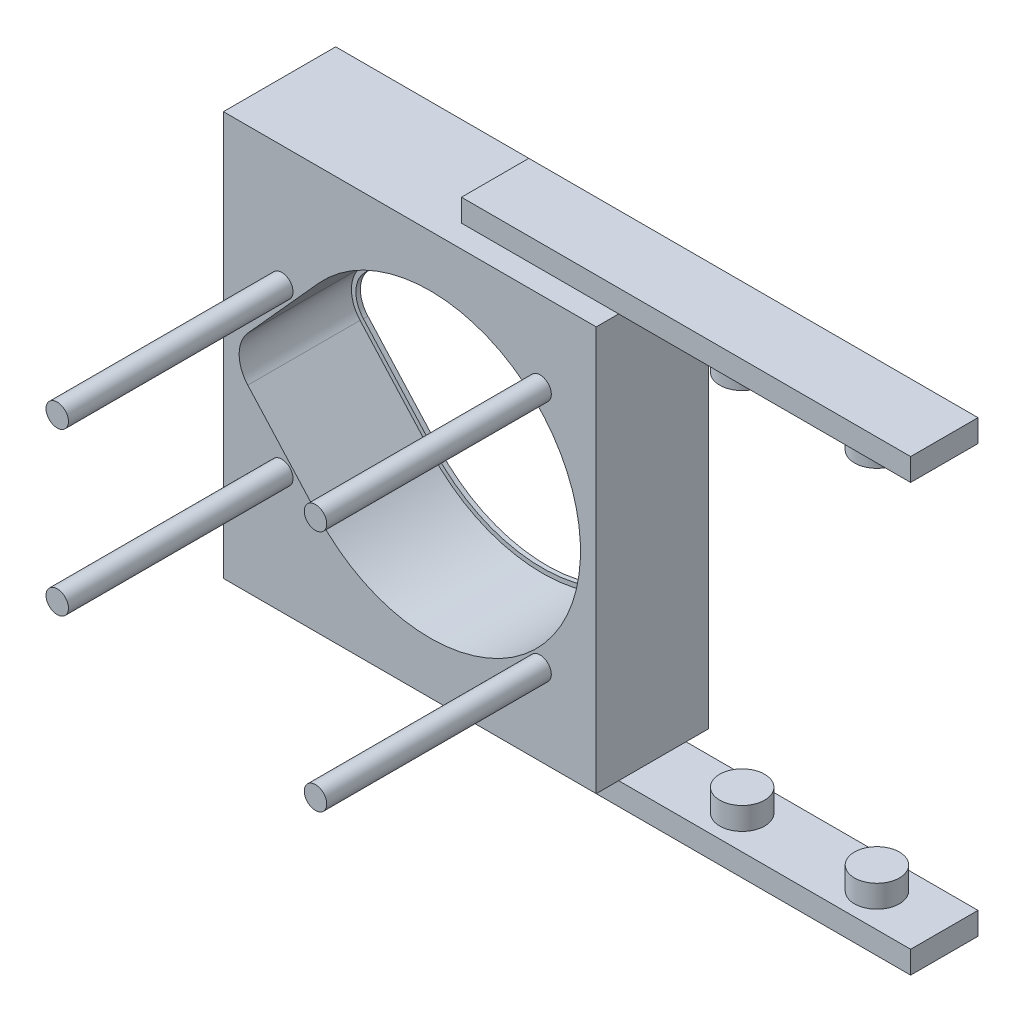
ISO-10303-21;
HEADER;
FILE_DESCRIPTION(('STEP AP214'),'2;1');
FILE_NAME('part.step','',(''),(''),'','','');
FILE_SCHEMA(('AUTOMOTIVE_DESIGN { 1 0 10303 214 1 1 1 1 }'));
ENDSEC;
DATA;
#1=APPLICATION_CONTEXT('core data for automotive mechanical design processes');
#2=APPLICATION_PROTOCOL_DEFINITION('international standard','automotive_design',2000,#1);
#3=PRODUCT_CONTEXT('',#1,'mechanical');
#4=PRODUCT('Part','Part','',(#3));
#5=PRODUCT_RELATED_PRODUCT_CATEGORY('part','',(#4));
#6=PRODUCT_DEFINITION_FORMATION('','',#4);
#7=PRODUCT_DEFINITION_CONTEXT('part definition',#1,'design');
#8=PRODUCT_DEFINITION('design','',#6,#7);
#9=PRODUCT_DEFINITION_SHAPE('','',#8);
#10=(LENGTH_UNIT() NAMED_UNIT(*) SI_UNIT(.MILLI.,.METRE.));
#11=(NAMED_UNIT(*) PLANE_ANGLE_UNIT() SI_UNIT($,.RADIAN.));
#12=(NAMED_UNIT(*) SI_UNIT($,.STERADIAN.) SOLID_ANGLE_UNIT());
#13=UNCERTAINTY_MEASURE_WITH_UNIT(LENGTH_MEASURE(1.E-05),#10,'distance_accuracy_value','');
#14=(GEOMETRIC_REPRESENTATION_CONTEXT(3) GLOBAL_UNCERTAINTY_ASSIGNED_CONTEXT((#13)) GLOBAL_UNIT_ASSIGNED_CONTEXT((#10,
#11,#12)) REPRESENTATION_CONTEXT('',''));
#15=CARTESIAN_POINT('',(0.,0.,0.));
#16=DIRECTION('',(0.,0.,1.));
#17=DIRECTION('',(1.,0.,0.));
#18=AXIS2_PLACEMENT_3D('',#15,#16,#17);
#19=CARTESIAN_POINT('',(0.,90.,0.));
#20=DIRECTION('',(0.,0.,-1.));
#21=DIRECTION('',(-1.,0.,0.));
#22=AXIS2_PLACEMENT_3D('',#19,#20,#21);
#23=PLANE('',#22);
#24=DIRECTION('',(0.,-1.,0.));
#25=VECTOR('',#24,1.);
#26=CARTESIAN_POINT('',(0.,0.,0.));
#27=LINE('',#26,#25);
#28=CARTESIAN_POINT('',(0.,90.,0.));
#29=VERTEX_POINT('',#28);
#30=CARTESIAN_POINT('',(0.,0.,0.));
#31=VERTEX_POINT('',#30);
#32=EDGE_CURVE('E400',#29,#31,#27,.T.);
#33=ORIENTED_EDGE('',*,*,#32,.F.);
#34=DIRECTION('',(-1.,0.,0.));
#35=VECTOR('',#34,1.);
#36=CARTESIAN_POINT('',(0.,90.,0.));
#37=LINE('',#36,#35);
#38=CARTESIAN_POINT('',(83.,90.,0.));
#39=VERTEX_POINT('',#38);
#40=EDGE_CURVE('E409',#39,#29,#37,.T.);
#41=ORIENTED_EDGE('',*,*,#40,.F.);
#42=DIRECTION('',(0.,1.,0.));
#43=VECTOR('',#42,1.);
#44=CARTESIAN_POINT('',(83.,0.,0.));
#45=LINE('',#44,#43);
#46=CARTESIAN_POINT('',(83.,0.,0.));
#47=VERTEX_POINT('',#46);
#48=EDGE_CURVE('E406',#47,#39,#45,.T.);
#49=ORIENTED_EDGE('',*,*,#48,.F.);
#50=DIRECTION('',(1.,0.,0.));
#51=VECTOR('',#50,1.);
#52=CARTESIAN_POINT('',(0.,0.,0.));
#53=LINE('',#52,#51);
#54=EDGE_CURVE('E403',#31,#47,#53,.T.);
#55=ORIENTED_EDGE('',*,*,#54,.F.);
#56=EDGE_LOOP('',(#33,#41,#49,#55));
#57=FACE_BOUND('',#56,.T.);
#58=DIRECTION('',(-0.66944997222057,0.742857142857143,0.));
#59=VECTOR('',#58,1.);
#60=CARTESIAN_POINT('',(20.3714285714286,21.9039759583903,0.));
#61=LINE('',#60,#59);
#62=CARTESIAN_POINT('',(20.3714285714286,21.9039759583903,0.));
#63=VERTEX_POINT('',#62);
#64=CARTESIAN_POINT('',(4.68571428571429,39.3096752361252,0.));
#65=VERTEX_POINT('',#64);
#66=EDGE_CURVE('E246',#63,#65,#61,.T.);
#67=ORIENTED_EDGE('',*,*,#66,.F.);
#68=CARTESIAN_POINT('',(46.,45.,0.));
#69=DIRECTION('',(0.,0.,-1.));
#70=DIRECTION('',(-1.,0.,0.));
#71=AXIS2_PLACEMENT_3D('',#68,#69,#70);
#72=CIRCLE('',#71,34.5);
#73=CARTESIAN_POINT('',(20.3714285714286,68.0960240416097,0.));
#74=VERTEX_POINT('',#73);
#75=EDGE_CURVE('E220',#74,#63,#72,.T.);
#76=ORIENTED_EDGE('',*,*,#75,.F.);
#77=DIRECTION('',(0.669449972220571,0.742857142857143,0.));
#78=VECTOR('',#77,1.);
#79=CARTESIAN_POINT('',(4.68571428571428,50.6903247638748,0.));
#80=LINE('',#79,#78);
#81=CARTESIAN_POINT('',(4.68571428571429,50.6903247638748,0.));
#82=VERTEX_POINT('',#81);
#83=EDGE_CURVE('E250',#82,#74,#80,.T.);
#84=ORIENTED_EDGE('',*,*,#83,.F.);
#85=CARTESIAN_POINT('',(11.,45.,0.));
#86=DIRECTION('',(0.,0.,-1.));
#87=DIRECTION('',(-1.,0.,0.));
#88=AXIS2_PLACEMENT_3D('',#85,#86,#87);
#89=CIRCLE('',#88,8.5);
#90=EDGE_CURVE('E248',#65,#82,#89,.T.);
#91=ORIENTED_EDGE('',*,*,#90,.F.);
#92=EDGE_LOOP('',(#67,#76,#84,#91));
#93=FACE_BOUND('',#92,.T.);
#94=ADVANCED_FACE('F26',(#57,#93),#23,.T.);
#95=CARTESIAN_POINT('',(0.,90.,25.));
#96=DIRECTION('',(0.,0.,-1.));
#97=DIRECTION('',(-1.,0.,0.));
#98=AXIS2_PLACEMENT_3D('',#95,#96,#97);
#99=PLANE('',#98);
#100=CARTESIAN_POINT('',(70.5,18.,25.));
#101=DIRECTION('',(0.,0.,-1.));
#102=DIRECTION('',(-1.,0.,0.));
#103=AXIS2_PLACEMENT_3D('',#100,#101,#102);
#104=CIRCLE('',#103,2.5);
#105=CARTESIAN_POINT('',(68.,18.,25.));
#106=VERTEX_POINT('',#105);
#107=EDGE_CURVE('E34',#106,#106,#104,.F.);
#108=ORIENTED_EDGE('',*,*,#107,.F.);
#109=EDGE_LOOP('',(#108));
#110=FACE_BOUND('',#109,.T.);
#111=CARTESIAN_POINT('',(13.,63.,25.));
#112=DIRECTION('',(0.,0.,-1.));
#113=DIRECTION('',(-1.,0.,0.));
#114=AXIS2_PLACEMENT_3D('',#111,#112,#113);
#115=CIRCLE('',#114,2.5);
#116=CARTESIAN_POINT('',(10.5,63.,25.));
#117=VERTEX_POINT('',#116);
#118=EDGE_CURVE('E442',#117,#117,#115,.F.);
#119=ORIENTED_EDGE('',*,*,#118,.F.);
#120=EDGE_LOOP('',(#119));
#121=FACE_BOUND('',#120,.T.);
#122=DIRECTION('',(0.66944997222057,-0.742857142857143,0.));
#123=VECTOR('',#122,1.);
#124=CARTESIAN_POINT('',(5.42857142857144,39.9791252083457,25.));
#125=LINE('',#124,#123);
#126=CARTESIAN_POINT('',(5.42857142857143,39.9791252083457,25.));
#127=VERTEX_POINT('',#126);
#128=CARTESIAN_POINT('',(21.1142857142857,22.5734259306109,25.));
#129=VERTEX_POINT('',#128);
#130=EDGE_CURVE('E283',#127,#129,#125,.T.);
#131=ORIENTED_EDGE('',*,*,#130,.F.);
#132=CARTESIAN_POINT('',(11.,45.,25.));
#133=DIRECTION('',(0.,0.,1.));
#134=DIRECTION('',(1.,0.,0.));
#135=AXIS2_PLACEMENT_3D('',#132,#133,#134);
#136=CIRCLE('',#135,7.5);
#137=CARTESIAN_POINT('',(5.42857142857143,50.0208747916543,25.));
#138=VERTEX_POINT('',#137);
#139=EDGE_CURVE('E49',#138,#127,#136,.T.);
#140=ORIENTED_EDGE('',*,*,#139,.F.);
#141=DIRECTION('',(-0.669449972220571,-0.742857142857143,0.));
#142=VECTOR('',#141,1.);
#143=CARTESIAN_POINT('',(5.42857142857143,50.0208747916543,25.));
#144=LINE('',#143,#142);
#145=CARTESIAN_POINT('',(21.1142857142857,67.4265740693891,25.));
#146=VERTEX_POINT('',#145);
#147=EDGE_CURVE('E289',#146,#138,#144,.T.);
#148=ORIENTED_EDGE('',*,*,#147,.F.);
#149=CARTESIAN_POINT('',(46.,45.,25.));
#150=DIRECTION('',(0.,0.,1.));
#151=DIRECTION('',(1.,0.,0.));
#152=AXIS2_PLACEMENT_3D('',#149,#150,#151);
#153=CIRCLE('',#152,33.5);
#154=EDGE_CURVE('E286',#129,#146,#153,.T.);
#155=ORIENTED_EDGE('',*,*,#154,.F.);
#156=EDGE_LOOP('',(#131,#140,#148,#155));
#157=FACE_BOUND('',#156,.T.);
#158=DIRECTION('',(0.,-1.,0.));
#159=VECTOR('',#158,1.);
#160=CARTESIAN_POINT('',(0.,0.,25.));
#161=LINE('',#160,#159);
#162=CARTESIAN_POINT('',(0.,90.,25.));
#163=VERTEX_POINT('',#162);
#164=CARTESIAN_POINT('',(0.,0.,25.));
#165=VERTEX_POINT('',#164);
#166=EDGE_CURVE('E411',#163,#165,#161,.T.);
#167=ORIENTED_EDGE('',*,*,#166,.T.);
#168=DIRECTION('',(1.,0.,0.));
#169=VECTOR('',#168,1.);
#170=CARTESIAN_POINT('',(0.,0.,25.));
#171=LINE('',#170,#169);
#172=CARTESIAN_POINT('',(83.,0.,25.));
#173=VERTEX_POINT('',#172);
#174=EDGE_CURVE('E414',#165,#173,#171,.T.);
#175=ORIENTED_EDGE('',*,*,#174,.T.);
#176=DIRECTION('',(0.,1.,0.));
#177=VECTOR('',#176,1.);
#178=CARTESIAN_POINT('',(83.,0.,25.));
#179=LINE('',#178,#177);
#180=CARTESIAN_POINT('',(83.,90.,25.));
#181=VERTEX_POINT('',#180);
#182=EDGE_CURVE('E417',#173,#181,#179,.T.);
#183=ORIENTED_EDGE('',*,*,#182,.T.);
#184=DIRECTION('',(-1.,0.,0.));
#185=VECTOR('',#184,1.);
#186=CARTESIAN_POINT('',(0.,90.,25.));
#187=LINE('',#186,#185);
#188=EDGE_CURVE('E419',#181,#163,#187,.T.);
#189=ORIENTED_EDGE('',*,*,#188,.T.);
#190=EDGE_LOOP('',(#167,#175,#183,#189));
#191=FACE_BOUND('',#190,.T.);
#192=CARTESIAN_POINT('',(70.5,72.,25.));
#193=DIRECTION('',(0.,0.,-1.));
#194=DIRECTION('',(-1.,0.,0.));
#195=AXIS2_PLACEMENT_3D('',#192,#193,#194);
#196=CIRCLE('',#195,2.5);
#197=CARTESIAN_POINT('',(68.,72.,25.));
#198=VERTEX_POINT('',#197);
#199=EDGE_CURVE('E445',#198,#198,#196,.F.);
#200=ORIENTED_EDGE('',*,*,#199,.F.);
#201=EDGE_LOOP('',(#200));
#202=FACE_BOUND('',#201,.T.);
#203=CARTESIAN_POINT('',(13.,27.,25.));
#204=DIRECTION('',(0.,0.,-1.));
#205=DIRECTION('',(-1.,0.,0.));
#206=AXIS2_PLACEMENT_3D('',#203,#204,#205);
#207=CIRCLE('',#206,2.5);
#208=CARTESIAN_POINT('',(10.5,27.,25.));
#209=VERTEX_POINT('',#208);
#210=EDGE_CURVE('E11',#209,#209,#207,.F.);
#211=ORIENTED_EDGE('',*,*,#210,.F.);
#212=EDGE_LOOP('',(#211));
#213=FACE_BOUND('',#212,.T.);
#214=ADVANCED_FACE('F452',(#110,#121,#157,#191,#202,#213),#99,.F.);
#215=CARTESIAN_POINT('',(48.,90.,20.));
#216=DIRECTION('',(0.,1.,0.));
#217=DIRECTION('',(0.,0.,1.));
#218=AXIS2_PLACEMENT_3D('',#215,#216,#217);
#219=PLANE('',#218);
#220=CARTESIAN_POINT('',(103.,90.,12.5));
#221=DIRECTION('',(0.,1.,0.));
#222=DIRECTION('',(0.,0.,1.));
#223=AXIS2_PLACEMENT_3D('',#220,#221,#222);
#224=CIRCLE('',#223,5.);
#225=CARTESIAN_POINT('',(103.,90.,17.5));
#226=VERTEX_POINT('',#225);
#227=EDGE_CURVE('E436',#226,#226,#224,.F.);
#228=ORIENTED_EDGE('',*,*,#227,.F.);
#229=EDGE_LOOP('',(#228));
#230=FACE_BOUND('',#229,.T.);
#231=DIRECTION('',(1.,0.,0.));
#232=VECTOR('',#231,1.);
#233=CARTESIAN_POINT('',(48.,90.,20.));
#234=LINE('',#233,#232);
#235=CARTESIAN_POINT('',(83.,90.,20.));
#236=VERTEX_POINT('',#235);
#237=CARTESIAN_POINT('',(148.,90.,20.));
#238=VERTEX_POINT('',#237);
#239=EDGE_CURVE('E369',#236,#238,#234,.T.);
#240=ORIENTED_EDGE('',*,*,#239,.F.);
#241=DIRECTION('',(0.,0.,-1.));
#242=VECTOR('',#241,1.);
#243=CARTESIAN_POINT('',(83.,90.,25.));
#244=LINE('',#243,#242);
#245=CARTESIAN_POINT('',(83.,90.,4.99999999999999));
#246=VERTEX_POINT('',#245);
#247=EDGE_CURVE('E428',#236,#246,#244,.T.);
#248=ORIENTED_EDGE('',*,*,#247,.T.);
#249=DIRECTION('',(-1.,0.,0.));
#250=VECTOR('',#249,1.);
#251=CARTESIAN_POINT('',(48.,90.,5.));
#252=LINE('',#251,#250);
#253=CARTESIAN_POINT('',(148.,90.,4.99999999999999));
#254=VERTEX_POINT('',#253);
#255=EDGE_CURVE('E375',#254,#246,#252,.T.);
#256=ORIENTED_EDGE('',*,*,#255,.F.);
#257=DIRECTION('',(0.,0.,-1.));
#258=VECTOR('',#257,1.);
#259=CARTESIAN_POINT('',(148.,90.,4.99999999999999));
#260=LINE('',#259,#258);
#261=EDGE_CURVE('E373',#238,#254,#260,.T.);
#262=ORIENTED_EDGE('',*,*,#261,.F.);
#263=EDGE_LOOP('',(#240,#248,#256,#262));
#264=FACE_BOUND('',#263,.T.);
#265=CARTESIAN_POINT('',(133.,90.,12.5));
#266=DIRECTION('',(0.,1.,0.));
#267=DIRECTION('',(0.,0.,1.));
#268=AXIS2_PLACEMENT_3D('',#265,#266,#267);
#269=CIRCLE('',#268,4.99999999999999);
#270=CARTESIAN_POINT('',(133.,90.,17.5));
#271=VERTEX_POINT('',#270);
#272=EDGE_CURVE('E439',#271,#271,#269,.F.);
#273=ORIENTED_EDGE('',*,*,#272,.F.);
#274=EDGE_LOOP('',(#273));
#275=FACE_BOUND('',#274,.T.);
#276=ADVANCED_FACE('F455',(#230,#264,#275),#219,.F.);
#277=CARTESIAN_POINT('',(0.,90.,25.));
#278=DIRECTION('',(0.,-1.,0.));
#279=DIRECTION('',(0.,0.,-1.));
#280=AXIS2_PLACEMENT_3D('',#277,#278,#279);
#281=PLANE('',#280);
#282=CARTESIAN_POINT('',(48.,90.,5.));
#283=VERTEX_POINT('',#282);
#284=EDGE_CURVE('E379',#246,#283,#252,.T.);
#285=ORIENTED_EDGE('',*,*,#284,.F.);
#286=EDGE_CURVE('E424',#246,#39,#244,.T.);
#287=ORIENTED_EDGE('',*,*,#286,.T.);
#288=ORIENTED_EDGE('',*,*,#40,.T.);
#289=DIRECTION('',(0.,0.,-1.));
#290=VECTOR('',#289,1.);
#291=CARTESIAN_POINT('',(0.,90.,25.));
#292=LINE('',#291,#290);
#293=EDGE_CURVE('E421',#163,#29,#292,.T.);
#294=ORIENTED_EDGE('',*,*,#293,.F.);
#295=ORIENTED_EDGE('',*,*,#188,.F.);
#296=EDGE_CURVE('E425',#181,#236,#244,.T.);
#297=ORIENTED_EDGE('',*,*,#296,.T.);
#298=CARTESIAN_POINT('',(48.,90.,20.));
#299=VERTEX_POINT('',#298);
#300=EDGE_CURVE('E370',#299,#236,#234,.T.);
#301=ORIENTED_EDGE('',*,*,#300,.F.);
#302=DIRECTION('',(0.,0.,1.));
#303=VECTOR('',#302,1.);
#304=CARTESIAN_POINT('',(48.,90.,5.));
#305=LINE('',#304,#303);
#306=EDGE_CURVE('E366',#283,#299,#305,.T.);
#307=ORIENTED_EDGE('',*,*,#306,.F.);
#308=EDGE_LOOP('',(#285,#287,#288,#294,#295,#297,#301,#307));
#309=FACE_BOUND('',#308,.T.);
#310=ADVANCED_FACE('F495',(#309),#281,.F.);
#311=CARTESIAN_POINT('',(0.,0.,25.));
#312=DIRECTION('',(1.,0.,0.));
#313=DIRECTION('',(0.,0.,-1.));
#314=AXIS2_PLACEMENT_3D('',#311,#312,#313);
#315=PLANE('',#314);
#316=ORIENTED_EDGE('',*,*,#32,.T.);
#317=DIRECTION('',(0.,0.,-1.));
#318=VECTOR('',#317,1.);
#319=CARTESIAN_POINT('',(0.,0.,25.));
#320=LINE('',#319,#318);
#321=EDGE_CURVE('E432',#165,#31,#320,.T.);
#322=ORIENTED_EDGE('',*,*,#321,.F.);
#323=ORIENTED_EDGE('',*,*,#166,.F.);
#324=ORIENTED_EDGE('',*,*,#293,.T.);
#325=EDGE_LOOP('',(#316,#322,#323,#324));
#326=FACE_BOUND('',#325,.T.);
#327=ADVANCED_FACE('F28',(#326),#315,.F.);
#328=CARTESIAN_POINT('',(0.,0.,25.));
#329=DIRECTION('',(0.,1.,0.));
#330=DIRECTION('',(0.,0.,1.));
#331=AXIS2_PLACEMENT_3D('',#328,#329,#330);
#332=PLANE('',#331);
#333=DIRECTION('',(0.,0.,1.));
#334=VECTOR('',#333,1.);
#335=CARTESIAN_POINT('',(48.,0.,5.));
#336=LINE('',#335,#334);
#337=CARTESIAN_POINT('',(48.,0.,5.));
#338=VERTEX_POINT('',#337);
#339=CARTESIAN_POINT('',(48.,0.,20.));
#340=VERTEX_POINT('',#339);
#341=EDGE_CURVE('E324',#338,#340,#336,.T.);
#342=ORIENTED_EDGE('',*,*,#341,.T.);
#343=DIRECTION('',(1.,0.,0.));
#344=VECTOR('',#343,1.);
#345=CARTESIAN_POINT('',(48.,0.,20.));
#346=LINE('',#345,#344);
#347=CARTESIAN_POINT('',(83.,0.,20.));
#348=VERTEX_POINT('',#347);
#349=EDGE_CURVE('E335',#340,#348,#346,.T.);
#350=ORIENTED_EDGE('',*,*,#349,.T.);
#351=DIRECTION('',(0.,0.,-1.));
#352=VECTOR('',#351,1.);
#353=CARTESIAN_POINT('',(83.,0.,25.));
#354=LINE('',#353,#352);
#355=EDGE_CURVE('E429',#173,#348,#354,.T.);
#356=ORIENTED_EDGE('',*,*,#355,.F.);
#357=ORIENTED_EDGE('',*,*,#174,.F.);
#358=ORIENTED_EDGE('',*,*,#321,.T.);
#359=ORIENTED_EDGE('',*,*,#54,.T.);
#360=CARTESIAN_POINT('',(83.,0.,4.99999999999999));
#361=VERTEX_POINT('',#360);
#362=EDGE_CURVE('E427',#361,#47,#354,.T.);
#363=ORIENTED_EDGE('',*,*,#362,.F.);
#364=DIRECTION('',(-1.,0.,0.));
#365=VECTOR('',#364,1.);
#366=CARTESIAN_POINT('',(48.,0.,5.));
#367=LINE('',#366,#365);
#368=EDGE_CURVE('E331',#361,#338,#367,.T.);
#369=ORIENTED_EDGE('',*,*,#368,.T.);
#370=EDGE_LOOP('',(#342,#350,#356,#357,#358,#359,#363,#369));
#371=FACE_BOUND('',#370,.T.);
#372=ADVANCED_FACE('F501',(#371),#332,.F.);
#373=CARTESIAN_POINT('',(83.,0.,25.));
#374=DIRECTION('',(-1.,0.,0.));
#375=DIRECTION('',(0.,0.,1.));
#376=AXIS2_PLACEMENT_3D('',#373,#374,#375);
#377=PLANE('',#376);
#378=ORIENTED_EDGE('',*,*,#48,.T.);
#379=ORIENTED_EDGE('',*,*,#286,.F.);
#380=ORIENTED_EDGE('',*,*,#247,.F.);
#381=ORIENTED_EDGE('',*,*,#296,.F.);
#382=ORIENTED_EDGE('',*,*,#182,.F.);
#383=ORIENTED_EDGE('',*,*,#355,.T.);
#384=EDGE_CURVE('E433',#348,#361,#354,.T.);
#385=ORIENTED_EDGE('',*,*,#384,.T.);
#386=ORIENTED_EDGE('',*,*,#362,.T.);
#387=EDGE_LOOP('',(#378,#379,#380,#381,#382,#383,#385,#386));
#388=FACE_BOUND('',#387,.T.);
#389=ADVANCED_FACE('F499',(#388),#377,.F.);
#390=CARTESIAN_POINT('',(48.,95.,5.));
#391=DIRECTION('',(1.,0.,0.));
#392=DIRECTION('',(0.,0.,-1.));
#393=AXIS2_PLACEMENT_3D('',#390,#391,#392);
#394=PLANE('',#393);
#395=ORIENTED_EDGE('',*,*,#306,.T.);
#396=DIRECTION('',(0.,-1.,0.));
#397=VECTOR('',#396,1.);
#398=CARTESIAN_POINT('',(48.,95.,20.));
#399=LINE('',#398,#397);
#400=CARTESIAN_POINT('',(48.,95.,20.));
#401=VERTEX_POINT('',#400);
#402=EDGE_CURVE('E397',#401,#299,#399,.T.);
#403=ORIENTED_EDGE('',*,*,#402,.F.);
#404=DIRECTION('',(0.,0.,1.));
#405=VECTOR('',#404,1.);
#406=CARTESIAN_POINT('',(48.,95.,5.));
#407=LINE('',#406,#405);
#408=CARTESIAN_POINT('',(48.,95.,5.));
#409=VERTEX_POINT('',#408);
#410=EDGE_CURVE('E378',#409,#401,#407,.T.);
#411=ORIENTED_EDGE('',*,*,#410,.F.);
#412=DIRECTION('',(0.,-1.,0.));
#413=VECTOR('',#412,1.);
#414=CARTESIAN_POINT('',(48.,95.,5.));
#415=LINE('',#414,#413);
#416=EDGE_CURVE('E388',#409,#283,#415,.T.);
#417=ORIENTED_EDGE('',*,*,#416,.T.);
#418=EDGE_LOOP('',(#395,#403,#411,#417));
#419=FACE_BOUND('',#418,.T.);
#420=ADVANCED_FACE('F492',(#419),#394,.F.);
#421=CARTESIAN_POINT('',(48.,95.,20.));
#422=DIRECTION('',(0.,0.,-1.));
#423=DIRECTION('',(-1.,0.,0.));
#424=AXIS2_PLACEMENT_3D('',#421,#422,#423);
#425=PLANE('',#424);
#426=ORIENTED_EDGE('',*,*,#300,.T.);
#427=ORIENTED_EDGE('',*,*,#239,.T.);
#428=DIRECTION('',(0.,-1.,0.));
#429=VECTOR('',#428,1.);
#430=CARTESIAN_POINT('',(148.,95.,20.));
#431=LINE('',#430,#429);
#432=CARTESIAN_POINT('',(148.,95.,20.));
#433=VERTEX_POINT('',#432);
#434=EDGE_CURVE('E394',#433,#238,#431,.T.);
#435=ORIENTED_EDGE('',*,*,#434,.F.);
#436=DIRECTION('',(1.,0.,0.));
#437=VECTOR('',#436,1.);
#438=CARTESIAN_POINT('',(48.,95.,20.));
#439=LINE('',#438,#437);
#440=EDGE_CURVE('E382',#401,#433,#439,.T.);
#441=ORIENTED_EDGE('',*,*,#440,.F.);
#442=ORIENTED_EDGE('',*,*,#402,.T.);
#443=EDGE_LOOP('',(#426,#427,#435,#441,#442));
#444=FACE_BOUND('',#443,.T.);
#445=ADVANCED_FACE('F557',(#444),#425,.F.);
#446=CARTESIAN_POINT('',(148.,95.,4.99999999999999));
#447=DIRECTION('',(-1.,0.,0.));
#448=DIRECTION('',(0.,0.,1.));
#449=AXIS2_PLACEMENT_3D('',#446,#447,#448);
#450=PLANE('',#449);
#451=ORIENTED_EDGE('',*,*,#261,.T.);
#452=DIRECTION('',(0.,-1.,0.));
#453=VECTOR('',#452,1.);
#454=CARTESIAN_POINT('',(148.,95.,4.99999999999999));
#455=LINE('',#454,#453);
#456=CARTESIAN_POINT('',(148.,95.,4.99999999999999));
#457=VERTEX_POINT('',#456);
#458=EDGE_CURVE('E391',#457,#254,#455,.T.);
#459=ORIENTED_EDGE('',*,*,#458,.F.);
#460=DIRECTION('',(0.,0.,-1.));
#461=VECTOR('',#460,1.);
#462=CARTESIAN_POINT('',(148.,95.,4.99999999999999));
#463=LINE('',#462,#461);
#464=EDGE_CURVE('E384',#433,#457,#463,.T.);
#465=ORIENTED_EDGE('',*,*,#464,.F.);
#466=ORIENTED_EDGE('',*,*,#434,.T.);
#467=EDGE_LOOP('',(#451,#459,#465,#466));
#468=FACE_BOUND('',#467,.T.);
#469=ADVANCED_FACE('F554',(#468),#450,.F.);
#470=CARTESIAN_POINT('',(48.,95.,5.));
#471=DIRECTION('',(0.,0.,1.));
#472=DIRECTION('',(1.,0.,0.));
#473=AXIS2_PLACEMENT_3D('',#470,#471,#472);
#474=PLANE('',#473);
#475=ORIENTED_EDGE('',*,*,#255,.T.);
#476=ORIENTED_EDGE('',*,*,#284,.T.);
#477=ORIENTED_EDGE('',*,*,#416,.F.);
#478=DIRECTION('',(-1.,0.,0.));
#479=VECTOR('',#478,1.);
#480=CARTESIAN_POINT('',(48.,95.,5.));
#481=LINE('',#480,#479);
#482=EDGE_CURVE('E386',#457,#409,#481,.T.);
#483=ORIENTED_EDGE('',*,*,#482,.F.);
#484=ORIENTED_EDGE('',*,*,#458,.T.);
#485=EDGE_LOOP('',(#475,#476,#477,#483,#484));
#486=FACE_BOUND('',#485,.T.);
#487=ADVANCED_FACE('F548',(#486),#474,.F.);
#488=CARTESIAN_POINT('',(48.,95.,20.));
#489=DIRECTION('',(0.,1.,0.));
#490=DIRECTION('',(0.,0.,1.));
#491=AXIS2_PLACEMENT_3D('',#488,#489,#490);
#492=PLANE('',#491);
#493=ORIENTED_EDGE('',*,*,#410,.T.);
#494=ORIENTED_EDGE('',*,*,#440,.T.);
#495=ORIENTED_EDGE('',*,*,#464,.T.);
#496=ORIENTED_EDGE('',*,*,#482,.T.);
#497=EDGE_LOOP('',(#493,#494,#495,#496));
#498=FACE_BOUND('',#497,.T.);
#499=ADVANCED_FACE('F563',(#498),#492,.T.);
#500=CARTESIAN_POINT('',(103.,85.,12.5));
#501=DIRECTION('',(0.,1.,0.));
#502=DIRECTION('',(0.,0.,1.));
#503=AXIS2_PLACEMENT_3D('',#500,#501,#502);
#504=CYLINDRICAL_SURFACE('',#503,5.);
#505=CARTESIAN_POINT('',(103.,85.,12.5));
#506=DIRECTION('',(0.,-1.,0.));
#507=DIRECTION('',(0.,0.,-1.));
#508=AXIS2_PLACEMENT_3D('',#505,#506,#507);
#509=CIRCLE('',#508,5.);
#510=CARTESIAN_POINT('',(103.,85.,7.49999999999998));
#511=VERTEX_POINT('',#510);
#512=EDGE_CURVE('E363',#511,#511,#509,.T.);
#513=ORIENTED_EDGE('',*,*,#512,.F.);
#514=EDGE_LOOP('',(#513));
#515=FACE_BOUND('',#514,.T.);
#516=ORIENTED_EDGE('',*,*,#227,.T.);
#517=EDGE_LOOP('',(#516));
#518=FACE_BOUND('',#517,.T.);
#519=ADVANCED_FACE('F565',(#515,#518),#504,.T.);
#520=CARTESIAN_POINT('',(103.,85.,12.5));
#521=DIRECTION('',(0.,-1.,0.));
#522=DIRECTION('',(0.,0.,-1.));
#523=AXIS2_PLACEMENT_3D('',#520,#521,#522);
#524=PLANE('',#523);
#525=ORIENTED_EDGE('',*,*,#512,.T.);
#526=EDGE_LOOP('',(#525));
#527=FACE_BOUND('',#526,.T.);
#528=ADVANCED_FACE('F571',(#527),#524,.T.);
#529=CARTESIAN_POINT('',(133.,85.,12.5));
#530=DIRECTION('',(0.,1.,0.));
#531=DIRECTION('',(0.,0.,1.));
#532=AXIS2_PLACEMENT_3D('',#529,#530,#531);
#533=CYLINDRICAL_SURFACE('',#532,4.99999999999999);
#534=CARTESIAN_POINT('',(133.,85.,12.5));
#535=DIRECTION('',(0.,-1.,0.));
#536=DIRECTION('',(0.,0.,-1.));
#537=AXIS2_PLACEMENT_3D('',#534,#535,#536);
#538=CIRCLE('',#537,4.99999999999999);
#539=CARTESIAN_POINT('',(133.,85.,7.49999999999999));
#540=VERTEX_POINT('',#539);
#541=EDGE_CURVE('E360',#540,#540,#538,.T.);
#542=ORIENTED_EDGE('',*,*,#541,.F.);
#543=EDGE_LOOP('',(#542));
#544=FACE_BOUND('',#543,.T.);
#545=ORIENTED_EDGE('',*,*,#272,.T.);
#546=EDGE_LOOP('',(#545));
#547=FACE_BOUND('',#546,.T.);
#548=ADVANCED_FACE('F800',(#544,#547),#533,.T.);
#549=CARTESIAN_POINT('',(133.,85.,12.5));
#550=DIRECTION('',(0.,-1.,0.));
#551=DIRECTION('',(0.,0.,-1.));
#552=AXIS2_PLACEMENT_3D('',#549,#550,#551);
#553=PLANE('',#552);
#554=ORIENTED_EDGE('',*,*,#541,.T.);
#555=EDGE_LOOP('',(#554));
#556=FACE_BOUND('',#555,.T.);
#557=ADVANCED_FACE('F797',(#556),#553,.T.);
#558=CARTESIAN_POINT('',(48.,-5.,5.));
#559=DIRECTION('',(-1.,0.,0.));
#560=DIRECTION('',(0.,0.,1.));
#561=AXIS2_PLACEMENT_3D('',#558,#559,#560);
#562=PLANE('',#561);
#563=ORIENTED_EDGE('',*,*,#341,.F.);
#564=DIRECTION('',(0.,1.,0.));
#565=VECTOR('',#564,1.);
#566=CARTESIAN_POINT('',(48.,-5.,5.));
#567=LINE('',#566,#565);
#568=CARTESIAN_POINT('',(48.,-5.,5.));
#569=VERTEX_POINT('',#568);
#570=EDGE_CURVE('E357',#569,#338,#567,.T.);
#571=ORIENTED_EDGE('',*,*,#570,.F.);
#572=DIRECTION('',(0.,0.,1.));
#573=VECTOR('',#572,1.);
#574=CARTESIAN_POINT('',(48.,-5.,5.));
#575=LINE('',#574,#573);
#576=CARTESIAN_POINT('',(48.,-5.,20.));
#577=VERTEX_POINT('',#576);
#578=EDGE_CURVE('E338',#569,#577,#575,.T.);
#579=ORIENTED_EDGE('',*,*,#578,.T.);
#580=DIRECTION('',(0.,1.,0.));
#581=VECTOR('',#580,1.);
#582=CARTESIAN_POINT('',(48.,-5.,20.));
#583=LINE('',#582,#581);
#584=EDGE_CURVE('E350',#577,#340,#583,.T.);
#585=ORIENTED_EDGE('',*,*,#584,.T.);
#586=EDGE_LOOP('',(#563,#571,#579,#585));
#587=FACE_BOUND('',#586,.T.);
#588=ADVANCED_FACE('F514',(#587),#562,.T.);
#589=CARTESIAN_POINT('',(48.,-5.,5.));
#590=DIRECTION('',(0.,0.,-1.));
#591=DIRECTION('',(-1.,0.,0.));
#592=AXIS2_PLACEMENT_3D('',#589,#590,#591);
#593=PLANE('',#592);
#594=CARTESIAN_POINT('',(148.,0.,4.99999999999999));
#595=VERTEX_POINT('',#594);
#596=EDGE_CURVE('E327',#595,#361,#367,.T.);
#597=ORIENTED_EDGE('',*,*,#596,.F.);
#598=DIRECTION('',(0.,1.,0.));
#599=VECTOR('',#598,1.);
#600=CARTESIAN_POINT('',(148.,-5.,4.99999999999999));
#601=LINE('',#600,#599);
#602=CARTESIAN_POINT('',(148.,-5.,4.99999999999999));
#603=VERTEX_POINT('',#602);
#604=EDGE_CURVE('E355',#603,#595,#601,.T.);
#605=ORIENTED_EDGE('',*,*,#604,.F.);
#606=DIRECTION('',(-1.,0.,0.));
#607=VECTOR('',#606,1.);
#608=CARTESIAN_POINT('',(48.,-5.,5.));
#609=LINE('',#608,#607);
#610=EDGE_CURVE('E341',#603,#569,#609,.T.);
#611=ORIENTED_EDGE('',*,*,#610,.T.);
#612=ORIENTED_EDGE('',*,*,#570,.T.);
#613=ORIENTED_EDGE('',*,*,#368,.F.);
#614=EDGE_LOOP('',(#597,#605,#611,#612,#613));
#615=FACE_BOUND('',#614,.T.);
#616=ADVANCED_FACE('F518',(#615),#593,.T.);
#617=CARTESIAN_POINT('',(148.,-5.,4.99999999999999));
#618=DIRECTION('',(1.,0.,0.));
#619=DIRECTION('',(0.,0.,-1.));
#620=AXIS2_PLACEMENT_3D('',#617,#618,#619);
#621=PLANE('',#620);
#622=DIRECTION('',(0.,0.,-1.));
#623=VECTOR('',#622,1.);
#624=CARTESIAN_POINT('',(148.,0.,4.99999999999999));
#625=LINE('',#624,#623);
#626=CARTESIAN_POINT('',(148.,0.,20.));
#627=VERTEX_POINT('',#626);
#628=EDGE_CURVE('E330',#627,#595,#625,.T.);
#629=ORIENTED_EDGE('',*,*,#628,.F.);
#630=DIRECTION('',(0.,1.,0.));
#631=VECTOR('',#630,1.);
#632=CARTESIAN_POINT('',(148.,-5.,20.));
#633=LINE('',#632,#631);
#634=CARTESIAN_POINT('',(148.,-5.,20.));
#635=VERTEX_POINT('',#634);
#636=EDGE_CURVE('E352',#635,#627,#633,.T.);
#637=ORIENTED_EDGE('',*,*,#636,.F.);
#638=DIRECTION('',(0.,0.,-1.));
#639=VECTOR('',#638,1.);
#640=CARTESIAN_POINT('',(148.,-5.,4.99999999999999));
#641=LINE('',#640,#639);
#642=EDGE_CURVE('E344',#635,#603,#641,.T.);
#643=ORIENTED_EDGE('',*,*,#642,.T.);
#644=ORIENTED_EDGE('',*,*,#604,.T.);
#645=EDGE_LOOP('',(#629,#637,#643,#644));
#646=FACE_BOUND('',#645,.T.);
#647=ADVANCED_FACE('F526',(#646),#621,.T.);
#648=CARTESIAN_POINT('',(48.,-5.,20.));
#649=DIRECTION('',(0.,0.,1.));
#650=DIRECTION('',(1.,0.,0.));
#651=AXIS2_PLACEMENT_3D('',#648,#649,#650);
#652=PLANE('',#651);
#653=ORIENTED_EDGE('',*,*,#349,.F.);
#654=ORIENTED_EDGE('',*,*,#584,.F.);
#655=DIRECTION('',(1.,0.,0.));
#656=VECTOR('',#655,1.);
#657=CARTESIAN_POINT('',(48.,-5.,20.));
#658=LINE('',#657,#656);
#659=EDGE_CURVE('E347',#577,#635,#658,.T.);
#660=ORIENTED_EDGE('',*,*,#659,.T.);
#661=ORIENTED_EDGE('',*,*,#636,.T.);
#662=EDGE_CURVE('E334',#348,#627,#346,.T.);
#663=ORIENTED_EDGE('',*,*,#662,.F.);
#664=EDGE_LOOP('',(#653,#654,#660,#661,#663));
#665=FACE_BOUND('',#664,.T.);
#666=ADVANCED_FACE('F529',(#665),#652,.T.);
#667=CARTESIAN_POINT('',(48.,-5.,20.));
#668=DIRECTION('',(0.,-1.,0.));
#669=DIRECTION('',(0.,0.,1.));
#670=AXIS2_PLACEMENT_3D('',#667,#668,#669);
#671=PLANE('',#670);
#672=ORIENTED_EDGE('',*,*,#578,.F.);
#673=ORIENTED_EDGE('',*,*,#610,.F.);
#674=ORIENTED_EDGE('',*,*,#642,.F.);
#675=ORIENTED_EDGE('',*,*,#659,.F.);
#676=EDGE_LOOP('',(#672,#673,#674,#675));
#677=FACE_BOUND('',#676,.T.);
#678=ADVANCED_FACE('F522',(#677),#671,.T.);
#679=CARTESIAN_POINT('',(48.,0.,20.));
#680=DIRECTION('',(0.,-1.,0.));
#681=DIRECTION('',(0.,0.,1.));
#682=AXIS2_PLACEMENT_3D('',#679,#680,#681);
#683=PLANE('',#682);
#684=CARTESIAN_POINT('',(133.,0.,12.5));
#685=DIRECTION('',(0.,-1.,0.));
#686=DIRECTION('',(0.,0.,-1.));
#687=AXIS2_PLACEMENT_3D('',#684,#685,#686);
#688=CIRCLE('',#687,4.99999999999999);
#689=CARTESIAN_POINT('',(133.,0.,7.49999999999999));
#690=VERTEX_POINT('',#689);
#691=EDGE_CURVE('E307',#690,#690,#688,.T.);
#692=ORIENTED_EDGE('',*,*,#691,.T.);
#693=EDGE_LOOP('',(#692));
#694=FACE_BOUND('',#693,.T.);
#695=CARTESIAN_POINT('',(103.,0.,12.5));
#696=DIRECTION('',(0.,-1.,0.));
#697=DIRECTION('',(0.,0.,-1.));
#698=AXIS2_PLACEMENT_3D('',#695,#696,#697);
#699=CIRCLE('',#698,5.);
#700=CARTESIAN_POINT('',(103.,0.,7.49999999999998));
#701=VERTEX_POINT('',#700);
#702=EDGE_CURVE('E318',#701,#701,#699,.T.);
#703=ORIENTED_EDGE('',*,*,#702,.T.);
#704=EDGE_LOOP('',(#703));
#705=FACE_BOUND('',#704,.T.);
#706=ORIENTED_EDGE('',*,*,#384,.F.);
#707=ORIENTED_EDGE('',*,*,#662,.T.);
#708=ORIENTED_EDGE('',*,*,#628,.T.);
#709=ORIENTED_EDGE('',*,*,#596,.T.);
#710=EDGE_LOOP('',(#706,#707,#708,#709));
#711=FACE_BOUND('',#710,.T.);
#712=ADVANCED_FACE('F531',(#694,#705,#711),#683,.F.);
#713=CARTESIAN_POINT('',(103.,5.,12.5));
#714=DIRECTION('',(0.,-1.,0.));
#715=DIRECTION('',(0.,0.,-1.));
#716=AXIS2_PLACEMENT_3D('',#713,#714,#715);
#717=CYLINDRICAL_SURFACE('',#716,5.);
#718=CARTESIAN_POINT('',(103.,5.,12.5));
#719=DIRECTION('',(0.,-1.,0.));
#720=DIRECTION('',(0.,0.,-1.));
#721=AXIS2_PLACEMENT_3D('',#718,#719,#720);
#722=CIRCLE('',#721,5.);
#723=CARTESIAN_POINT('',(103.,5.,7.49999999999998));
#724=VERTEX_POINT('',#723);
#725=EDGE_CURVE('E321',#724,#724,#722,.T.);
#726=ORIENTED_EDGE('',*,*,#725,.T.);
#727=EDGE_LOOP('',(#726));
#728=FACE_BOUND('',#727,.T.);
#729=ORIENTED_EDGE('',*,*,#702,.F.);
#730=EDGE_LOOP('',(#729));
#731=FACE_BOUND('',#730,.T.);
#732=ADVANCED_FACE('F779',(#728,#731),#717,.T.);
#733=CARTESIAN_POINT('',(103.,5.,12.5));
#734=DIRECTION('',(0.,1.,0.));
#735=DIRECTION('',(0.,0.,-1.));
#736=AXIS2_PLACEMENT_3D('',#733,#734,#735);
#737=PLANE('',#736);
#738=ORIENTED_EDGE('',*,*,#725,.F.);
#739=EDGE_LOOP('',(#738));
#740=FACE_BOUND('',#739,.T.);
#741=ADVANCED_FACE('F775',(#740),#737,.T.);
#742=CARTESIAN_POINT('',(133.,5.,12.5));
#743=DIRECTION('',(0.,-1.,0.));
#744=DIRECTION('',(0.,0.,-1.));
#745=AXIS2_PLACEMENT_3D('',#742,#743,#744);
#746=CYLINDRICAL_SURFACE('',#745,4.99999999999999);
#747=CARTESIAN_POINT('',(133.,5.,12.5));
#748=DIRECTION('',(0.,-1.,0.));
#749=DIRECTION('',(0.,0.,-1.));
#750=AXIS2_PLACEMENT_3D('',#747,#748,#749);
#751=CIRCLE('',#750,4.99999999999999);
#752=CARTESIAN_POINT('',(133.,5.,7.49999999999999));
#753=VERTEX_POINT('',#752);
#754=EDGE_CURVE('E315',#753,#753,#751,.T.);
#755=ORIENTED_EDGE('',*,*,#754,.T.);
#756=EDGE_LOOP('',(#755));
#757=FACE_BOUND('',#756,.T.);
#758=ORIENTED_EDGE('',*,*,#691,.F.);
#759=EDGE_LOOP('',(#758));
#760=FACE_BOUND('',#759,.T.);
#761=ADVANCED_FACE('F771',(#757,#760),#746,.T.);
#762=CARTESIAN_POINT('',(133.,5.,12.5));
#763=DIRECTION('',(0.,1.,0.));
#764=DIRECTION('',(0.,0.,-1.));
#765=AXIS2_PLACEMENT_3D('',#762,#763,#764);
#766=PLANE('',#765);
#767=ORIENTED_EDGE('',*,*,#754,.F.);
#768=EDGE_LOOP('',(#767));
#769=FACE_BOUND('',#768,.T.);
#770=ADVANCED_FACE('F768',(#769),#766,.T.);
#771=CARTESIAN_POINT('',(11.,45.,0.));
#772=DIRECTION('',(0.,0.,1.));
#773=DIRECTION('',(1.,0.,0.));
#774=AXIS2_PLACEMENT_3D('',#771,#772,#773);
#775=CYLINDRICAL_SURFACE('',#774,7.5);
#776=ORIENTED_EDGE('',*,*,#139,.T.);
#777=DIRECTION('',(0.,0.,1.));
#778=VECTOR('',#777,1.);
#779=CARTESIAN_POINT('',(5.42857142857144,39.9791252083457,0.));
#780=LINE('',#779,#778);
#781=CARTESIAN_POINT('',(5.42857142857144,39.9791252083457,0.));
#782=VERTEX_POINT('',#781);
#783=EDGE_CURVE('E304',#782,#127,#780,.T.);
#784=ORIENTED_EDGE('',*,*,#783,.F.);
#785=CARTESIAN_POINT('',(11.,45.,0.));
#786=DIRECTION('',(0.,0.,1.));
#787=DIRECTION('',(1.,0.,0.));
#788=AXIS2_PLACEMENT_3D('',#785,#786,#787);
#789=CIRCLE('',#788,7.5);
#790=CARTESIAN_POINT('',(5.42857142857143,50.0208747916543,0.));
#791=VERTEX_POINT('',#790);
#792=EDGE_CURVE('E292',#791,#782,#789,.T.);
#793=ORIENTED_EDGE('',*,*,#792,.F.);
#794=DIRECTION('',(0.,0.,1.));
#795=VECTOR('',#794,1.);
#796=CARTESIAN_POINT('',(5.42857142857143,50.0208747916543,0.));
#797=LINE('',#796,#795);
#798=EDGE_CURVE('E305',#791,#138,#797,.T.);
#799=ORIENTED_EDGE('',*,*,#798,.T.);
#800=EDGE_LOOP('',(#776,#784,#793,#799));
#801=FACE_BOUND('',#800,.T.);
#802=ADVANCED_FACE('F759',(#801),#775,.F.);
#803=CARTESIAN_POINT('',(5.42857142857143,50.0208747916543,0.));
#804=DIRECTION('',(-0.742857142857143,0.66944997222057,0.));
#805=DIRECTION('',(-0.66944997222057,-0.742857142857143,0.));
#806=AXIS2_PLACEMENT_3D('',#803,#804,#805);
#807=PLANE('',#806);
#808=ORIENTED_EDGE('',*,*,#147,.T.);
#809=ORIENTED_EDGE('',*,*,#798,.F.);
#810=DIRECTION('',(-0.669449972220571,-0.742857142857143,0.));
#811=VECTOR('',#810,1.);
#812=CARTESIAN_POINT('',(5.42857142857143,50.0208747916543,0.));
#813=LINE('',#812,#811);
#814=CARTESIAN_POINT('',(21.1142857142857,67.4265740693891,0.));
#815=VERTEX_POINT('',#814);
#816=EDGE_CURVE('E301',#815,#791,#813,.T.);
#817=ORIENTED_EDGE('',*,*,#816,.F.);
#818=DIRECTION('',(0.,0.,1.));
#819=VECTOR('',#818,1.);
#820=CARTESIAN_POINT('',(21.1142857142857,67.4265740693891,0.));
#821=LINE('',#820,#819);
#822=EDGE_CURVE('E308',#815,#146,#821,.T.);
#823=ORIENTED_EDGE('',*,*,#822,.T.);
#824=EDGE_LOOP('',(#808,#809,#817,#823));
#825=FACE_BOUND('',#824,.T.);
#826=ADVANCED_FACE('F755',(#825),#807,.F.);
#827=CARTESIAN_POINT('',(46.,45.,0.));
#828=DIRECTION('',(0.,0.,1.));
#829=DIRECTION('',(1.,0.,0.));
#830=AXIS2_PLACEMENT_3D('',#827,#828,#829);
#831=CYLINDRICAL_SURFACE('',#830,33.5);
#832=ORIENTED_EDGE('',*,*,#154,.T.);
#833=ORIENTED_EDGE('',*,*,#822,.F.);
#834=CARTESIAN_POINT('',(46.,45.,0.));
#835=DIRECTION('',(0.,0.,1.));
#836=DIRECTION('',(1.,0.,0.));
#837=AXIS2_PLACEMENT_3D('',#834,#835,#836);
#838=CIRCLE('',#837,33.5);
#839=CARTESIAN_POINT('',(21.1142857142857,22.5734259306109,0.));
#840=VERTEX_POINT('',#839);
#841=EDGE_CURVE('E298',#840,#815,#838,.T.);
#842=ORIENTED_EDGE('',*,*,#841,.F.);
#843=DIRECTION('',(0.,0.,1.));
#844=VECTOR('',#843,1.);
#845=CARTESIAN_POINT('',(21.1142857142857,22.5734259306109,0.));
#846=LINE('',#845,#844);
#847=EDGE_CURVE('E310',#840,#129,#846,.T.);
#848=ORIENTED_EDGE('',*,*,#847,.T.);
#849=EDGE_LOOP('',(#832,#833,#842,#848));
#850=FACE_BOUND('',#849,.T.);
#851=ADVANCED_FACE('F758',(#850),#831,.F.);
#852=CARTESIAN_POINT('',(5.42857142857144,39.9791252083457,0.));
#853=DIRECTION('',(-0.742857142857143,-0.66944997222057,0.));
#854=DIRECTION('',(0.66944997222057,-0.742857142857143,0.));
#855=AXIS2_PLACEMENT_3D('',#852,#853,#854);
#856=PLANE('',#855);
#857=ORIENTED_EDGE('',*,*,#130,.T.);
#858=ORIENTED_EDGE('',*,*,#847,.F.);
#859=DIRECTION('',(0.66944997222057,-0.742857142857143,0.));
#860=VECTOR('',#859,1.);
#861=CARTESIAN_POINT('',(5.42857142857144,39.9791252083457,0.));
#862=LINE('',#861,#860);
#863=EDGE_CURVE('E295',#782,#840,#862,.T.);
#864=ORIENTED_EDGE('',*,*,#863,.F.);
#865=ORIENTED_EDGE('',*,*,#783,.T.);
#866=EDGE_LOOP('',(#857,#858,#864,#865));
#867=FACE_BOUND('',#866,.T.);
#868=ADVANCED_FACE('F613',(#867),#856,.F.);
#869=CARTESIAN_POINT('',(13.,63.,75.));
#870=DIRECTION('',(0.,0.,-1.));
#871=DIRECTION('',(-1.,0.,0.));
#872=AXIS2_PLACEMENT_3D('',#869,#870,#871);
#873=CYLINDRICAL_SURFACE('',#872,2.5);
#874=CARTESIAN_POINT('',(13.,63.,75.));
#875=DIRECTION('',(0.,0.,1.));
#876=DIRECTION('',(1.,0.,0.));
#877=AXIS2_PLACEMENT_3D('',#874,#875,#876);
#878=CIRCLE('',#877,2.5);
#879=CARTESIAN_POINT('',(15.5,63.,75.));
#880=VERTEX_POINT('',#879);
#881=EDGE_CURVE('E279',#880,#880,#878,.T.);
#882=ORIENTED_EDGE('',*,*,#881,.F.);
#883=EDGE_LOOP('',(#882));
#884=FACE_BOUND('',#883,.T.);
#885=ORIENTED_EDGE('',*,*,#118,.T.);
#886=EDGE_LOOP('',(#885));
#887=FACE_BOUND('',#886,.T.);
#888=ADVANCED_FACE('F618',(#884,#887),#873,.T.);
#889=CARTESIAN_POINT('',(13.,63.,75.));
#890=DIRECTION('',(0.,0.,1.));
#891=DIRECTION('',(1.,0.,0.));
#892=AXIS2_PLACEMENT_3D('',#889,#890,#891);
#893=PLANE('',#892);
#894=ORIENTED_EDGE('',*,*,#881,.T.);
#895=EDGE_LOOP('',(#894));
#896=FACE_BOUND('',#895,.T.);
#897=ADVANCED_FACE('F623',(#896),#893,.T.);
#898=CARTESIAN_POINT('',(70.5,72.,75.));
#899=DIRECTION('',(0.,0.,-1.));
#900=DIRECTION('',(-1.,0.,0.));
#901=AXIS2_PLACEMENT_3D('',#898,#899,#900);
#902=CYLINDRICAL_SURFACE('',#901,2.5);
#903=CARTESIAN_POINT('',(70.5,72.,75.));
#904=DIRECTION('',(0.,0.,1.));
#905=DIRECTION('',(1.,0.,0.));
#906=AXIS2_PLACEMENT_3D('',#903,#904,#905);
#907=CIRCLE('',#906,2.5);
#908=CARTESIAN_POINT('',(73.,72.,75.));
#909=VERTEX_POINT('',#908);
#910=EDGE_CURVE('E276',#909,#909,#907,.T.);
#911=ORIENTED_EDGE('',*,*,#910,.F.);
#912=EDGE_LOOP('',(#911));
#913=FACE_BOUND('',#912,.T.);
#914=ORIENTED_EDGE('',*,*,#199,.T.);
#915=EDGE_LOOP('',(#914));
#916=FACE_BOUND('',#915,.T.);
#917=ADVANCED_FACE('F631',(#913,#916),#902,.T.);
#918=CARTESIAN_POINT('',(70.5,72.,75.));
#919=DIRECTION('',(0.,0.,1.));
#920=DIRECTION('',(1.,0.,0.));
#921=AXIS2_PLACEMENT_3D('',#918,#919,#920);
#922=PLANE('',#921);
#923=ORIENTED_EDGE('',*,*,#910,.T.);
#924=EDGE_LOOP('',(#923));
#925=FACE_BOUND('',#924,.T.);
#926=ADVANCED_FACE('F639',(#925),#922,.T.);
#927=CARTESIAN_POINT('',(70.5,18.,75.));
#928=DIRECTION('',(0.,0.,-1.));
#929=DIRECTION('',(-1.,0.,0.));
#930=AXIS2_PLACEMENT_3D('',#927,#928,#929);
#931=CYLINDRICAL_SURFACE('',#930,2.5);
#932=CARTESIAN_POINT('',(70.5,18.,75.));
#933=DIRECTION('',(0.,0.,1.));
#934=DIRECTION('',(-1.,0.,0.));
#935=AXIS2_PLACEMENT_3D('',#932,#933,#934);
#936=CIRCLE('',#935,2.5);
#937=CARTESIAN_POINT('',(68.,18.,75.));
#938=VERTEX_POINT('',#937);
#939=EDGE_CURVE('E273',#938,#938,#936,.T.);
#940=ORIENTED_EDGE('',*,*,#939,.F.);
#941=EDGE_LOOP('',(#940));
#942=FACE_BOUND('',#941,.T.);
#943=ORIENTED_EDGE('',*,*,#107,.T.);
#944=EDGE_LOOP('',(#943));
#945=FACE_BOUND('',#944,.T.);
#946=ADVANCED_FACE('F450',(#942,#945),#931,.T.);
#947=CARTESIAN_POINT('',(70.5,18.,75.));
#948=DIRECTION('',(0.,0.,-1.));
#949=DIRECTION('',(-1.,0.,0.));
#950=AXIS2_PLACEMENT_3D('',#947,#948,#949);
#951=PLANE('',#950);
#952=ORIENTED_EDGE('',*,*,#939,.T.);
#953=EDGE_LOOP('',(#952));
#954=FACE_BOUND('',#953,.T.);
#955=ADVANCED_FACE('F472',(#954),#951,.F.);
#956=CARTESIAN_POINT('',(13.,27.,75.));
#957=DIRECTION('',(0.,0.,-1.));
#958=DIRECTION('',(-1.,0.,0.));
#959=AXIS2_PLACEMENT_3D('',#956,#957,#958);
#960=CYLINDRICAL_SURFACE('',#959,2.5);
#961=CARTESIAN_POINT('',(13.,27.,75.));
#962=DIRECTION('',(0.,0.,1.));
#963=DIRECTION('',(-1.,0.,0.));
#964=AXIS2_PLACEMENT_3D('',#961,#962,#963);
#965=CIRCLE('',#964,2.5);
#966=CARTESIAN_POINT('',(10.5,27.,75.));
#967=VERTEX_POINT('',#966);
#968=EDGE_CURVE('E270',#967,#967,#965,.T.);
#969=ORIENTED_EDGE('',*,*,#968,.F.);
#970=EDGE_LOOP('',(#969));
#971=FACE_BOUND('',#970,.T.);
#972=ORIENTED_EDGE('',*,*,#210,.T.);
#973=EDGE_LOOP('',(#972));
#974=FACE_BOUND('',#973,.T.);
#975=ADVANCED_FACE('F469',(#971,#974),#960,.T.);
#976=CARTESIAN_POINT('',(13.,27.,75.));
#977=DIRECTION('',(0.,0.,-1.));
#978=DIRECTION('',(-1.,0.,0.));
#979=AXIS2_PLACEMENT_3D('',#976,#977,#978);
#980=PLANE('',#979);
#981=ORIENTED_EDGE('',*,*,#968,.T.);
#982=EDGE_LOOP('',(#981));
#983=FACE_BOUND('',#982,.T.);
#984=ADVANCED_FACE('F471',(#983),#980,.F.);
#985=CARTESIAN_POINT('',(46.,45.,0.));
#986=DIRECTION('',(0.,0.,-1.));
#987=DIRECTION('',(-1.,0.,0.));
#988=AXIS2_PLACEMENT_3D('',#985,#986,#987);
#989=PLANE('',#988);
#990=CARTESIAN_POINT('',(46.,45.,0.));
#991=DIRECTION('',(0.,0.,-1.));
#992=DIRECTION('',(-1.,0.,0.));
#993=AXIS2_PLACEMENT_3D('',#990,#991,#992);
#994=CIRCLE('',#993,32.5);
#995=CARTESIAN_POINT('',(21.8571428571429,66.7571240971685,0.));
#996=VERTEX_POINT('',#995);
#997=CARTESIAN_POINT('',(21.8571428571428,23.2428759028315,0.));
#998=VERTEX_POINT('',#997);
#999=EDGE_CURVE('E212',#996,#998,#994,.T.);
#1000=ORIENTED_EDGE('',*,*,#999,.T.);
#1001=DIRECTION('',(-0.66944997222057,0.742857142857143,0.));
#1002=VECTOR('',#1001,1.);
#1003=CARTESIAN_POINT('',(21.8571428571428,23.2428759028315,0.));
#1004=LINE('',#1003,#1002);
#1005=CARTESIAN_POINT('',(6.17142857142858,40.6485751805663,0.));
#1006=VERTEX_POINT('',#1005);
#1007=EDGE_CURVE('E200',#998,#1006,#1004,.T.);
#1008=ORIENTED_EDGE('',*,*,#1007,.T.);
#1009=CARTESIAN_POINT('',(11.,45.,0.));
#1010=DIRECTION('',(0.,0.,-1.));
#1011=DIRECTION('',(-1.,0.,0.));
#1012=AXIS2_PLACEMENT_3D('',#1009,#1010,#1011);
#1013=CIRCLE('',#1012,6.49999999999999);
#1014=CARTESIAN_POINT('',(6.17142857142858,49.3514248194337,0.));
#1015=VERTEX_POINT('',#1014);
#1016=EDGE_CURVE('E211',#1006,#1015,#1013,.T.);
#1017=ORIENTED_EDGE('',*,*,#1016,.T.);
#1018=DIRECTION('',(0.66944997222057,0.742857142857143,0.));
#1019=VECTOR('',#1018,1.);
#1020=CARTESIAN_POINT('',(6.17142857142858,49.3514248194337,0.));
#1021=LINE('',#1020,#1019);
#1022=EDGE_CURVE('E226',#1015,#996,#1021,.T.);
#1023=ORIENTED_EDGE('',*,*,#1022,.T.);
#1024=EDGE_LOOP('',(#1000,#1008,#1017,#1023));
#1025=FACE_BOUND('',#1024,.T.);
#1026=ORIENTED_EDGE('',*,*,#816,.T.);
#1027=ORIENTED_EDGE('',*,*,#792,.T.);
#1028=ORIENTED_EDGE('',*,*,#863,.T.);
#1029=ORIENTED_EDGE('',*,*,#841,.T.);
#1030=EDGE_LOOP('',(#1026,#1027,#1028,#1029));
#1031=FACE_BOUND('',#1030,.T.);
#1032=ADVANCED_FACE('F223',(#1025,#1031),#989,.F.);
#1033=CARTESIAN_POINT('',(46.,45.,-1.));
#1034=DIRECTION('',(0.,0.,-1.));
#1035=DIRECTION('',(-1.,0.,0.));
#1036=AXIS2_PLACEMENT_3D('',#1033,#1034,#1035);
#1037=PLANE('',#1036);
#1038=CARTESIAN_POINT('',(46.,45.,-1.));
#1039=DIRECTION('',(0.,0.,-1.));
#1040=DIRECTION('',(-1.,0.,0.));
#1041=AXIS2_PLACEMENT_3D('',#1038,#1039,#1040);
#1042=CIRCLE('',#1041,34.5);
#1043=CARTESIAN_POINT('',(20.3714285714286,68.0960240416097,-1.));
#1044=VERTEX_POINT('',#1043);
#1045=CARTESIAN_POINT('',(20.3714285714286,21.9039759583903,-1.));
#1046=VERTEX_POINT('',#1045);
#1047=EDGE_CURVE('E252',#1044,#1046,#1042,.T.);
#1048=ORIENTED_EDGE('',*,*,#1047,.T.);
#1049=DIRECTION('',(-0.66944997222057,0.742857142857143,0.));
#1050=VECTOR('',#1049,1.);
#1051=CARTESIAN_POINT('',(20.3714285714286,21.9039759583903,-1.));
#1052=LINE('',#1051,#1050);
#1053=CARTESIAN_POINT('',(4.68571428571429,39.3096752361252,-1.));
#1054=VERTEX_POINT('',#1053);
#1055=EDGE_CURVE('E255',#1046,#1054,#1052,.T.);
#1056=ORIENTED_EDGE('',*,*,#1055,.T.);
#1057=CARTESIAN_POINT('',(11.,45.,-1.));
#1058=DIRECTION('',(0.,0.,-1.));
#1059=DIRECTION('',(-1.,0.,0.));
#1060=AXIS2_PLACEMENT_3D('',#1057,#1058,#1059);
#1061=CIRCLE('',#1060,8.5);
#1062=CARTESIAN_POINT('',(4.68571428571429,50.6903247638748,-1.));
#1063=VERTEX_POINT('',#1062);
#1064=EDGE_CURVE('E257',#1054,#1063,#1061,.T.);
#1065=ORIENTED_EDGE('',*,*,#1064,.T.);
#1066=DIRECTION('',(0.669449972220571,0.742857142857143,0.));
#1067=VECTOR('',#1066,1.);
#1068=CARTESIAN_POINT('',(4.68571428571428,50.6903247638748,-1.));
#1069=LINE('',#1068,#1067);
#1070=EDGE_CURVE('E259',#1063,#1044,#1069,.T.);
#1071=ORIENTED_EDGE('',*,*,#1070,.T.);
#1072=EDGE_LOOP('',(#1048,#1056,#1065,#1071));
#1073=FACE_BOUND('',#1072,.T.);
#1074=DIRECTION('',(-0.66944997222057,0.742857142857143,0.));
#1075=VECTOR('',#1074,1.);
#1076=CARTESIAN_POINT('',(21.8571428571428,23.2428759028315,-1.));
#1077=LINE('',#1076,#1075);
#1078=CARTESIAN_POINT('',(21.8571428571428,23.2428759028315,-1.));
#1079=VERTEX_POINT('',#1078);
#1080=CARTESIAN_POINT('',(6.17142857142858,40.6485751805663,-1.));
#1081=VERTEX_POINT('',#1080);
#1082=EDGE_CURVE('E232',#1079,#1081,#1077,.T.);
#1083=ORIENTED_EDGE('',*,*,#1082,.F.);
#1084=CARTESIAN_POINT('',(46.,45.,-1.));
#1085=DIRECTION('',(0.,0.,-1.));
#1086=DIRECTION('',(-1.,0.,0.));
#1087=AXIS2_PLACEMENT_3D('',#1084,#1085,#1086);
#1088=CIRCLE('',#1087,32.5);
#1089=CARTESIAN_POINT('',(21.8571428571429,66.7571240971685,-1.));
#1090=VERTEX_POINT('',#1089);
#1091=EDGE_CURVE('E219',#1090,#1079,#1088,.T.);
#1092=ORIENTED_EDGE('',*,*,#1091,.F.);
#1093=DIRECTION('',(0.66944997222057,0.742857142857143,0.));
#1094=VECTOR('',#1093,1.);
#1095=CARTESIAN_POINT('',(6.17142857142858,49.3514248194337,-1.));
#1096=LINE('',#1095,#1094);
#1097=CARTESIAN_POINT('',(6.17142857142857,49.3514248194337,-1.));
#1098=VERTEX_POINT('',#1097);
#1099=EDGE_CURVE('E237',#1098,#1090,#1096,.T.);
#1100=ORIENTED_EDGE('',*,*,#1099,.F.);
#1101=CARTESIAN_POINT('',(11.,45.,-1.));
#1102=DIRECTION('',(0.,0.,-1.));
#1103=DIRECTION('',(-1.,0.,0.));
#1104=AXIS2_PLACEMENT_3D('',#1101,#1102,#1103);
#1105=CIRCLE('',#1104,6.49999999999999);
#1106=EDGE_CURVE('E234',#1081,#1098,#1105,.T.);
#1107=ORIENTED_EDGE('',*,*,#1106,.F.);
#1108=EDGE_LOOP('',(#1083,#1092,#1100,#1107));
#1109=FACE_BOUND('',#1108,.T.);
#1110=ADVANCED_FACE('F673',(#1073,#1109),#1037,.T.);
#1111=CARTESIAN_POINT('',(46.,45.,-1.));
#1112=DIRECTION('',(0.,0.,1.));
#1113=DIRECTION('',(1.,0.,0.));
#1114=AXIS2_PLACEMENT_3D('',#1111,#1112,#1113);
#1115=CYLINDRICAL_SURFACE('',#1114,34.5);
#1116=ORIENTED_EDGE('',*,*,#75,.T.);
#1117=DIRECTION('',(0.,0.,1.));
#1118=VECTOR('',#1117,1.);
#1119=CARTESIAN_POINT('',(20.3714285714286,21.9039759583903,-1.));
#1120=LINE('',#1119,#1118);
#1121=EDGE_CURVE('E268',#1046,#63,#1120,.T.);
#1122=ORIENTED_EDGE('',*,*,#1121,.F.);
#1123=ORIENTED_EDGE('',*,*,#1047,.F.);
#1124=DIRECTION('',(0.,0.,1.));
#1125=VECTOR('',#1124,1.);
#1126=CARTESIAN_POINT('',(20.3714285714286,68.0960240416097,-1.));
#1127=LINE('',#1126,#1125);
#1128=EDGE_CURVE('E261',#1044,#74,#1127,.T.);
#1129=ORIENTED_EDGE('',*,*,#1128,.T.);
#1130=EDGE_LOOP('',(#1116,#1122,#1123,#1129));
#1131=FACE_BOUND('',#1130,.T.);
#1132=ADVANCED_FACE('F680',(#1131),#1115,.T.);
#1133=CARTESIAN_POINT('',(20.3714285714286,21.9039759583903,-1.));
#1134=DIRECTION('',(0.742857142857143,0.66944997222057,0.));
#1135=DIRECTION('',(-0.66944997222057,0.742857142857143,0.));
#1136=AXIS2_PLACEMENT_3D('',#1133,#1134,#1135);
#1137=PLANE('',#1136);
#1138=ORIENTED_EDGE('',*,*,#66,.T.);
#1139=DIRECTION('',(0.,0.,1.));
#1140=VECTOR('',#1139,1.);
#1141=CARTESIAN_POINT('',(4.68571428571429,39.3096752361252,-1.));
#1142=LINE('',#1141,#1140);
#1143=EDGE_CURVE('E265',#1054,#65,#1142,.T.);
#1144=ORIENTED_EDGE('',*,*,#1143,.F.);
#1145=ORIENTED_EDGE('',*,*,#1055,.F.);
#1146=ORIENTED_EDGE('',*,*,#1121,.T.);
#1147=EDGE_LOOP('',(#1138,#1144,#1145,#1146));
#1148=FACE_BOUND('',#1147,.T.);
#1149=ADVANCED_FACE('F688',(#1148),#1137,.F.);
#1150=CARTESIAN_POINT('',(11.,45.,-1.));
#1151=DIRECTION('',(0.,0.,1.));
#1152=DIRECTION('',(1.,0.,0.));
#1153=AXIS2_PLACEMENT_3D('',#1150,#1151,#1152);
#1154=CYLINDRICAL_SURFACE('',#1153,8.5);
#1155=ORIENTED_EDGE('',*,*,#90,.T.);
#1156=DIRECTION('',(0.,0.,1.));
#1157=VECTOR('',#1156,1.);
#1158=CARTESIAN_POINT('',(4.68571428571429,50.6903247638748,-1.));
#1159=LINE('',#1158,#1157);
#1160=EDGE_CURVE('E41',#1063,#82,#1159,.T.);
#1161=ORIENTED_EDGE('',*,*,#1160,.F.);
#1162=ORIENTED_EDGE('',*,*,#1064,.F.);
#1163=ORIENTED_EDGE('',*,*,#1143,.T.);
#1164=EDGE_LOOP('',(#1155,#1161,#1162,#1163));
#1165=FACE_BOUND('',#1164,.T.);
#1166=ADVANCED_FACE('F696',(#1165),#1154,.T.);
#1167=CARTESIAN_POINT('',(4.68571428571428,50.6903247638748,-1.));
#1168=DIRECTION('',(0.742857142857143,-0.669449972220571,0.));
#1169=DIRECTION('',(0.669449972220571,0.742857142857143,0.));
#1170=AXIS2_PLACEMENT_3D('',#1167,#1168,#1169);
#1171=PLANE('',#1170);
#1172=ORIENTED_EDGE('',*,*,#83,.T.);
#1173=ORIENTED_EDGE('',*,*,#1128,.F.);
#1174=ORIENTED_EDGE('',*,*,#1070,.F.);
#1175=ORIENTED_EDGE('',*,*,#1160,.T.);
#1176=EDGE_LOOP('',(#1172,#1173,#1174,#1175));
#1177=FACE_BOUND('',#1176,.T.);
#1178=ADVANCED_FACE('F704',(#1177),#1171,.F.);
#1179=CARTESIAN_POINT('',(46.,45.,-1.));
#1180=DIRECTION('',(0.,0.,1.));
#1181=DIRECTION('',(1.,0.,0.));
#1182=AXIS2_PLACEMENT_3D('',#1179,#1180,#1181);
#1183=CYLINDRICAL_SURFACE('',#1182,32.5);
#1184=ORIENTED_EDGE('',*,*,#999,.F.);
#1185=DIRECTION('',(0.,0.,1.));
#1186=VECTOR('',#1185,1.);
#1187=CARTESIAN_POINT('',(21.8571428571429,66.7571240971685,-1.));
#1188=LINE('',#1187,#1186);
#1189=EDGE_CURVE('E239',#1090,#996,#1188,.T.);
#1190=ORIENTED_EDGE('',*,*,#1189,.F.);
#1191=ORIENTED_EDGE('',*,*,#1091,.T.);
#1192=DIRECTION('',(0.,0.,1.));
#1193=VECTOR('',#1192,1.);
#1194=CARTESIAN_POINT('',(21.8571428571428,23.2428759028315,-1.));
#1195=LINE('',#1194,#1193);
#1196=EDGE_CURVE('E203',#1079,#998,#1195,.T.);
#1197=ORIENTED_EDGE('',*,*,#1196,.T.);
#1198=EDGE_LOOP('',(#1184,#1190,#1191,#1197));
#1199=FACE_BOUND('',#1198,.T.);
#1200=ADVANCED_FACE('F215',(#1199),#1183,.F.);
#1201=CARTESIAN_POINT('',(21.8571428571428,23.2428759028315,-1.));
#1202=DIRECTION('',(0.742857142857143,0.66944997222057,0.));
#1203=DIRECTION('',(-0.66944997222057,0.742857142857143,0.));
#1204=AXIS2_PLACEMENT_3D('',#1201,#1202,#1203);
#1205=PLANE('',#1204);
#1206=ORIENTED_EDGE('',*,*,#1007,.F.);
#1207=ORIENTED_EDGE('',*,*,#1196,.F.);
#1208=ORIENTED_EDGE('',*,*,#1082,.T.);
#1209=DIRECTION('',(0.,0.,1.));
#1210=VECTOR('',#1209,1.);
#1211=CARTESIAN_POINT('',(6.17142857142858,40.6485751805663,-1.));
#1212=LINE('',#1211,#1210);
#1213=EDGE_CURVE('E206',#1081,#1006,#1212,.T.);
#1214=ORIENTED_EDGE('',*,*,#1213,.T.);
#1215=EDGE_LOOP('',(#1206,#1207,#1208,#1214));
#1216=FACE_BOUND('',#1215,.T.);
#1217=ADVANCED_FACE('F202',(#1216),#1205,.T.);
#1218=CARTESIAN_POINT('',(11.,45.,-1.));
#1219=DIRECTION('',(0.,0.,1.));
#1220=DIRECTION('',(1.,0.,0.));
#1221=AXIS2_PLACEMENT_3D('',#1218,#1219,#1220);
#1222=CYLINDRICAL_SURFACE('',#1221,6.49999999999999);
#1223=ORIENTED_EDGE('',*,*,#1016,.F.);
#1224=ORIENTED_EDGE('',*,*,#1213,.F.);
#1225=ORIENTED_EDGE('',*,*,#1106,.T.);
#1226=DIRECTION('',(0.,0.,1.));
#1227=VECTOR('',#1226,1.);
#1228=CARTESIAN_POINT('',(6.17142857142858,49.3514248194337,-1.));
#1229=LINE('',#1228,#1227);
#1230=EDGE_CURVE('E241',#1098,#1015,#1229,.T.);
#1231=ORIENTED_EDGE('',*,*,#1230,.T.);
#1232=EDGE_LOOP('',(#1223,#1224,#1225,#1231));
#1233=FACE_BOUND('',#1232,.T.);
#1234=ADVANCED_FACE('F724',(#1233),#1222,.F.);
#1235=CARTESIAN_POINT('',(6.17142857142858,49.3514248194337,-1.));
#1236=DIRECTION('',(0.742857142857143,-0.66944997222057,0.));
#1237=DIRECTION('',(0.66944997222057,0.742857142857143,0.));
#1238=AXIS2_PLACEMENT_3D('',#1235,#1236,#1237);
#1239=PLANE('',#1238);
#1240=ORIENTED_EDGE('',*,*,#1022,.F.);
#1241=ORIENTED_EDGE('',*,*,#1230,.F.);
#1242=ORIENTED_EDGE('',*,*,#1099,.T.);
#1243=ORIENTED_EDGE('',*,*,#1189,.T.);
#1244=EDGE_LOOP('',(#1240,#1241,#1242,#1243));
#1245=FACE_BOUND('',#1244,.T.);
#1246=ADVANCED_FACE('F731',(#1245),#1239,.T.);
#1247=CLOSED_SHELL('',(#94,#214,#276,#310,#327,#372,#389,#420,#445,#469,#487,#499,#519,#528,
#548,#557,#588,#616,#647,#666,#678,#712,#732,#741,#761,#770,#802,#826,#851,#868,#888,#897,#917,
#926,#946,#955,#975,#984,#1032,#1110,#1132,#1149,#1166,#1178,#1200,#1217,#1234,#1246));
#1248=MANIFOLD_SOLID_BREP('B2',#1247);
#1249=ADVANCED_BREP_SHAPE_REPRESENTATION('',(#18,#1248),#14);
#1250=SHAPE_DEFINITION_REPRESENTATION(#9,#1249);
ENDSEC;
END-ISO-10303-21;
